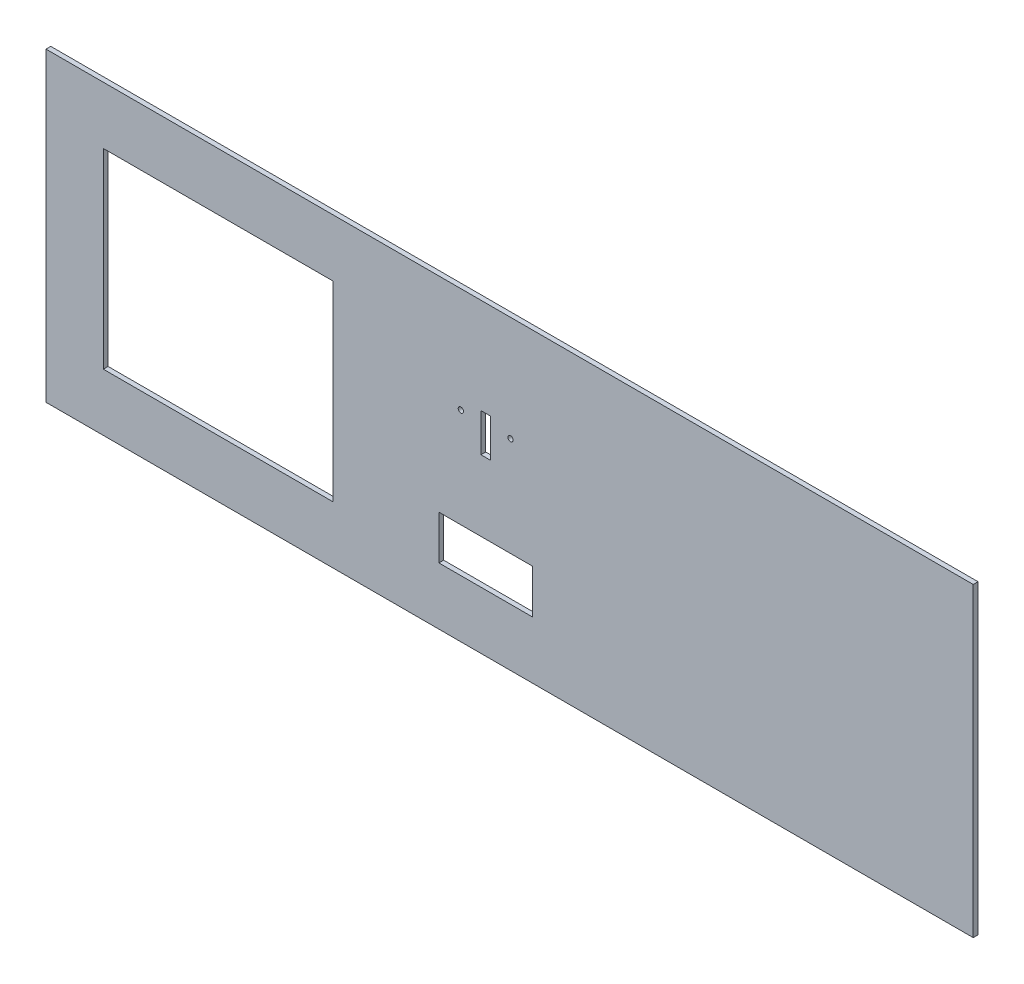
ISO-10303-21;
HEADER;
FILE_DESCRIPTION(('STEP AP214'),'2;1');
FILE_NAME('part.step','',(''),(''),'','','');
FILE_SCHEMA(('AUTOMOTIVE_DESIGN { 1 0 10303 214 1 1 1 1 }'));
ENDSEC;
DATA;
#1=APPLICATION_CONTEXT('core data for automotive mechanical design processes');
#2=APPLICATION_PROTOCOL_DEFINITION('international standard','automotive_design',2000,#1);
#3=PRODUCT_CONTEXT('',#1,'mechanical');
#4=PRODUCT('Part','Part','',(#3));
#5=PRODUCT_RELATED_PRODUCT_CATEGORY('part','',(#4));
#6=PRODUCT_DEFINITION_FORMATION('','',#4);
#7=PRODUCT_DEFINITION_CONTEXT('part definition',#1,'design');
#8=PRODUCT_DEFINITION('design','',#6,#7);
#9=PRODUCT_DEFINITION_SHAPE('','',#8);
#10=(LENGTH_UNIT() NAMED_UNIT(*) SI_UNIT(.MILLI.,.METRE.));
#11=(NAMED_UNIT(*) PLANE_ANGLE_UNIT() SI_UNIT($,.RADIAN.));
#12=(NAMED_UNIT(*) SI_UNIT($,.STERADIAN.) SOLID_ANGLE_UNIT());
#13=UNCERTAINTY_MEASURE_WITH_UNIT(LENGTH_MEASURE(1.E-05),#10,'distance_accuracy_value','');
#14=(GEOMETRIC_REPRESENTATION_CONTEXT(3) GLOBAL_UNCERTAINTY_ASSIGNED_CONTEXT((#13)) GLOBAL_UNIT_ASSIGNED_CONTEXT((#10,
#11,#12)) REPRESENTATION_CONTEXT('',''));
#15=CARTESIAN_POINT('',(0.,0.,0.));
#16=DIRECTION('',(0.,0.,1.));
#17=DIRECTION('',(1.,0.,0.));
#18=AXIS2_PLACEMENT_3D('',#15,#16,#17);
#19=CARTESIAN_POINT('',(307.975,-101.6,3.175));
#20=DIRECTION('',(-1.,0.,0.));
#21=DIRECTION('',(0.,0.,1.));
#22=AXIS2_PLACEMENT_3D('',#19,#20,#21);
#23=PLANE('',#22);
#24=DIRECTION('',(0.,1.,0.));
#25=VECTOR('',#24,1.);
#26=CARTESIAN_POINT('',(307.975,-101.6,0.));
#27=LINE('',#26,#25);
#28=CARTESIAN_POINT('',(307.975,-101.6,0.));
#29=VERTEX_POINT('',#28);
#30=CARTESIAN_POINT('',(307.975,101.6,0.));
#31=VERTEX_POINT('',#30);
#32=EDGE_CURVE('E285',#29,#31,#27,.T.);
#33=ORIENTED_EDGE('',*,*,#32,.T.);
#34=DIRECTION('',(0.,0.,-1.));
#35=VECTOR('',#34,1.);
#36=CARTESIAN_POINT('',(307.975,101.6,3.175));
#37=LINE('',#36,#35);
#38=CARTESIAN_POINT('',(307.975,101.6,3.175));
#39=VERTEX_POINT('',#38);
#40=EDGE_CURVE('E12',#39,#31,#37,.T.);
#41=ORIENTED_EDGE('',*,*,#40,.F.);
#42=DIRECTION('',(0.,1.,0.));
#43=VECTOR('',#42,1.);
#44=CARTESIAN_POINT('',(307.975,-101.6,3.175));
#45=LINE('',#44,#43);
#46=CARTESIAN_POINT('',(307.975,-101.6,3.175));
#47=VERTEX_POINT('',#46);
#48=EDGE_CURVE('E265',#47,#39,#45,.T.);
#49=ORIENTED_EDGE('',*,*,#48,.F.);
#50=DIRECTION('',(0.,0.,-1.));
#51=VECTOR('',#50,1.);
#52=CARTESIAN_POINT('',(307.975,-101.6,3.175));
#53=LINE('',#52,#51);
#54=EDGE_CURVE('E284',#47,#29,#53,.T.);
#55=ORIENTED_EDGE('',*,*,#54,.T.);
#56=EDGE_LOOP('',(#33,#41,#49,#55));
#57=FACE_BOUND('',#56,.T.);
#58=ADVANCED_FACE('F46',(#57),#23,.F.);
#59=CARTESIAN_POINT('',(-307.975,101.6,3.175));
#60=DIRECTION('',(0.,-1.,0.));
#61=DIRECTION('',(0.,0.,-1.));
#62=AXIS2_PLACEMENT_3D('',#59,#60,#61);
#63=PLANE('',#62);
#64=DIRECTION('',(-1.,0.,0.));
#65=VECTOR('',#64,1.);
#66=CARTESIAN_POINT('',(-307.975,101.6,0.));
#67=LINE('',#66,#65);
#68=CARTESIAN_POINT('',(-307.975,101.6,0.));
#69=VERTEX_POINT('',#68);
#70=EDGE_CURVE('E288',#31,#69,#67,.T.);
#71=ORIENTED_EDGE('',*,*,#70,.T.);
#72=DIRECTION('',(0.,0.,-1.));
#73=VECTOR('',#72,1.);
#74=CARTESIAN_POINT('',(-307.975,101.6,3.175));
#75=LINE('',#74,#73);
#76=CARTESIAN_POINT('',(-307.975,101.6,3.175));
#77=VERTEX_POINT('',#76);
#78=EDGE_CURVE('E53',#77,#69,#75,.T.);
#79=ORIENTED_EDGE('',*,*,#78,.F.);
#80=DIRECTION('',(-1.,0.,0.));
#81=VECTOR('',#80,1.);
#82=CARTESIAN_POINT('',(-307.975,101.6,3.175));
#83=LINE('',#82,#81);
#84=EDGE_CURVE('E270',#39,#77,#83,.T.);
#85=ORIENTED_EDGE('',*,*,#84,.F.);
#86=ORIENTED_EDGE('',*,*,#40,.T.);
#87=EDGE_LOOP('',(#71,#79,#85,#86));
#88=FACE_BOUND('',#87,.T.);
#89=ADVANCED_FACE('F318',(#88),#63,.F.);
#90=CARTESIAN_POINT('',(-307.975,-101.6,3.175));
#91=DIRECTION('',(1.,0.,0.));
#92=DIRECTION('',(0.,0.,-1.));
#93=AXIS2_PLACEMENT_3D('',#90,#91,#92);
#94=PLANE('',#93);
#95=DIRECTION('',(0.,-1.,0.));
#96=VECTOR('',#95,1.);
#97=CARTESIAN_POINT('',(-307.975,-101.6,0.));
#98=LINE('',#97,#96);
#99=CARTESIAN_POINT('',(-307.975,-101.6,0.));
#100=VERTEX_POINT('',#99);
#101=EDGE_CURVE('E291',#69,#100,#98,.T.);
#102=ORIENTED_EDGE('',*,*,#101,.T.);
#103=DIRECTION('',(0.,0.,-1.));
#104=VECTOR('',#103,1.);
#105=CARTESIAN_POINT('',(-307.975,-101.6,3.175));
#106=LINE('',#105,#104);
#107=CARTESIAN_POINT('',(-307.975,-101.6,3.175));
#108=VERTEX_POINT('',#107);
#109=EDGE_CURVE('E296',#108,#100,#106,.T.);
#110=ORIENTED_EDGE('',*,*,#109,.F.);
#111=DIRECTION('',(0.,-1.,0.));
#112=VECTOR('',#111,1.);
#113=CARTESIAN_POINT('',(-307.975,-101.6,3.175));
#114=LINE('',#113,#112);
#115=EDGE_CURVE('E277',#77,#108,#114,.T.);
#116=ORIENTED_EDGE('',*,*,#115,.F.);
#117=ORIENTED_EDGE('',*,*,#78,.T.);
#118=EDGE_LOOP('',(#102,#110,#116,#117));
#119=FACE_BOUND('',#118,.T.);
#120=ADVANCED_FACE('F303',(#119),#94,.F.);
#121=CARTESIAN_POINT('',(-307.975,-101.6,3.175));
#122=DIRECTION('',(0.,1.,0.));
#123=DIRECTION('',(0.,0.,1.));
#124=AXIS2_PLACEMENT_3D('',#121,#122,#123);
#125=PLANE('',#124);
#126=DIRECTION('',(1.,0.,0.));
#127=VECTOR('',#126,1.);
#128=CARTESIAN_POINT('',(-307.975,-101.6,0.));
#129=LINE('',#128,#127);
#130=EDGE_CURVE('E271',#100,#29,#129,.T.);
#131=ORIENTED_EDGE('',*,*,#130,.T.);
#132=ORIENTED_EDGE('',*,*,#54,.F.);
#133=DIRECTION('',(1.,0.,0.));
#134=VECTOR('',#133,1.);
#135=CARTESIAN_POINT('',(-307.975,-101.6,3.175));
#136=LINE('',#135,#134);
#137=EDGE_CURVE('E280',#108,#47,#136,.T.);
#138=ORIENTED_EDGE('',*,*,#137,.F.);
#139=ORIENTED_EDGE('',*,*,#109,.T.);
#140=EDGE_LOOP('',(#131,#132,#138,#139));
#141=FACE_BOUND('',#140,.T.);
#142=ADVANCED_FACE('F311',(#141),#125,.F.);
#143=CARTESIAN_POINT('',(0.,0.,3.175));
#144=DIRECTION('',(0.,0.,-1.));
#145=DIRECTION('',(-1.,0.,0.));
#146=AXIS2_PLACEMENT_3D('',#143,#144,#145);
#147=PLANE('',#146);
#148=DIRECTION('',(-1.,0.,0.));
#149=VECTOR('',#148,1.);
#150=CARTESIAN_POINT('',(-46.9899999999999,-34.29,3.175));
#151=LINE('',#150,#149);
#152=CARTESIAN_POINT('',(15.2400000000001,-34.29,3.175));
#153=VERTEX_POINT('',#152);
#154=CARTESIAN_POINT('',(-46.9899999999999,-34.29,3.175));
#155=VERTEX_POINT('',#154);
#156=EDGE_CURVE('E188',#153,#155,#151,.T.);
#157=ORIENTED_EDGE('',*,*,#156,.F.);
#158=DIRECTION('',(0.,1.,0.));
#159=VECTOR('',#158,1.);
#160=CARTESIAN_POINT('',(15.2400000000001,-63.5,3.175));
#161=LINE('',#160,#159);
#162=CARTESIAN_POINT('',(15.2400000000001,-63.5,3.175));
#163=VERTEX_POINT('',#162);
#164=EDGE_CURVE('E60',#163,#153,#161,.T.);
#165=ORIENTED_EDGE('',*,*,#164,.F.);
#166=DIRECTION('',(1.,0.,0.));
#167=VECTOR('',#166,1.);
#168=CARTESIAN_POINT('',(-46.9899999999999,-63.5,3.175));
#169=LINE('',#168,#167);
#170=CARTESIAN_POINT('',(-46.9899999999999,-63.5,3.175));
#171=VERTEX_POINT('',#170);
#172=EDGE_CURVE('E176',#171,#163,#169,.T.);
#173=ORIENTED_EDGE('',*,*,#172,.F.);
#174=DIRECTION('',(0.,-1.,0.));
#175=VECTOR('',#174,1.);
#176=CARTESIAN_POINT('',(-46.9899999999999,-63.5,3.175));
#177=LINE('',#176,#175);
#178=EDGE_CURVE('E180',#155,#171,#177,.T.);
#179=ORIENTED_EDGE('',*,*,#178,.F.);
#180=EDGE_LOOP('',(#157,#165,#173,#179));
#181=FACE_BOUND('',#180,.T.);
#182=CARTESIAN_POINT('',(0.635000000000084,31.75,3.175));
#183=DIRECTION('',(0.,0.,1.));
#184=DIRECTION('',(1.,0.,0.));
#185=AXIS2_PLACEMENT_3D('',#182,#183,#184);
#186=CIRCLE('',#185,1.75);
#187=CARTESIAN_POINT('',(2.38500000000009,31.75,3.175));
#188=VERTEX_POINT('',#187);
#189=EDGE_CURVE('E209',#188,#188,#186,.T.);
#190=ORIENTED_EDGE('',*,*,#189,.F.);
#191=EDGE_LOOP('',(#190));
#192=FACE_BOUND('',#191,.T.);
#193=CARTESIAN_POINT('',(-32.3849999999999,31.75,3.175));
#194=DIRECTION('',(0.,0.,1.));
#195=DIRECTION('',(-1.,0.,0.));
#196=AXIS2_PLACEMENT_3D('',#193,#194,#195);
#197=CIRCLE('',#196,1.75);
#198=CARTESIAN_POINT('',(-34.1349999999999,31.75,3.175));
#199=VERTEX_POINT('',#198);
#200=EDGE_CURVE('E214',#199,#199,#197,.T.);
#201=ORIENTED_EDGE('',*,*,#200,.F.);
#202=EDGE_LOOP('',(#201));
#203=FACE_BOUND('',#202,.T.);
#204=DIRECTION('',(-1.,0.,0.));
#205=VECTOR('',#204,1.);
#206=CARTESIAN_POINT('',(-19.0499999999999,38.1,3.175));
#207=LINE('',#206,#205);
#208=CARTESIAN_POINT('',(-12.6999999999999,38.1,3.175));
#209=VERTEX_POINT('',#208);
#210=CARTESIAN_POINT('',(-19.0499999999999,38.1,3.175));
#211=VERTEX_POINT('',#210);
#212=EDGE_CURVE('E223',#209,#211,#207,.T.);
#213=ORIENTED_EDGE('',*,*,#212,.F.);
#214=DIRECTION('',(0.,1.,0.));
#215=VECTOR('',#214,1.);
#216=CARTESIAN_POINT('',(-12.6999999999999,12.7,3.175));
#217=LINE('',#216,#215);
#218=CARTESIAN_POINT('',(-12.6999999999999,12.7,3.175));
#219=VERTEX_POINT('',#218);
#220=EDGE_CURVE('E208',#219,#209,#217,.T.);
#221=ORIENTED_EDGE('',*,*,#220,.F.);
#222=DIRECTION('',(1.,0.,0.));
#223=VECTOR('',#222,1.);
#224=CARTESIAN_POINT('',(-19.0499999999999,12.7,3.175));
#225=LINE('',#224,#223);
#226=CARTESIAN_POINT('',(-19.0499999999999,12.7,3.175));
#227=VERTEX_POINT('',#226);
#228=EDGE_CURVE('E235',#227,#219,#225,.T.);
#229=ORIENTED_EDGE('',*,*,#228,.F.);
#230=DIRECTION('',(0.,-1.,0.));
#231=VECTOR('',#230,1.);
#232=CARTESIAN_POINT('',(-19.0499999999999,12.7,3.175));
#233=LINE('',#232,#231);
#234=EDGE_CURVE('E228',#211,#227,#233,.T.);
#235=ORIENTED_EDGE('',*,*,#234,.F.);
#236=EDGE_LOOP('',(#213,#221,#229,#235));
#237=FACE_BOUND('',#236,.T.);
#238=DIRECTION('',(1.,0.,0.));
#239=VECTOR('',#238,1.);
#240=CARTESIAN_POINT('',(-269.875,-63.5,3.175));
#241=LINE('',#240,#239);
#242=CARTESIAN_POINT('',(-269.875,-63.5,3.175));
#243=VERTEX_POINT('',#242);
#244=CARTESIAN_POINT('',(-117.475,-63.5,3.175));
#245=VERTEX_POINT('',#244);
#246=EDGE_CURVE('E244',#243,#245,#241,.T.);
#247=ORIENTED_EDGE('',*,*,#246,.F.);
#248=DIRECTION('',(0.,-1.,0.));
#249=VECTOR('',#248,1.);
#250=CARTESIAN_POINT('',(-269.875,-63.5,3.175));
#251=LINE('',#250,#249);
#252=CARTESIAN_POINT('',(-269.875,63.5,3.175));
#253=VERTEX_POINT('',#252);
#254=EDGE_CURVE('E250',#253,#243,#251,.T.);
#255=ORIENTED_EDGE('',*,*,#254,.F.);
#256=DIRECTION('',(-1.,0.,0.));
#257=VECTOR('',#256,1.);
#258=CARTESIAN_POINT('',(-269.875,63.5,3.175));
#259=LINE('',#258,#257);
#260=CARTESIAN_POINT('',(-117.475,63.5,3.175));
#261=VERTEX_POINT('',#260);
#262=EDGE_CURVE('E257',#261,#253,#259,.T.);
#263=ORIENTED_EDGE('',*,*,#262,.F.);
#264=DIRECTION('',(0.,1.,0.));
#265=VECTOR('',#264,1.);
#266=CARTESIAN_POINT('',(-117.475,-63.5,3.175));
#267=LINE('',#266,#265);
#268=EDGE_CURVE('E249',#245,#261,#267,.T.);
#269=ORIENTED_EDGE('',*,*,#268,.F.);
#270=EDGE_LOOP('',(#247,#255,#263,#269));
#271=FACE_BOUND('',#270,.T.);
#272=ORIENTED_EDGE('',*,*,#48,.T.);
#273=ORIENTED_EDGE('',*,*,#84,.T.);
#274=ORIENTED_EDGE('',*,*,#115,.T.);
#275=ORIENTED_EDGE('',*,*,#137,.T.);
#276=EDGE_LOOP('',(#272,#273,#274,#275));
#277=FACE_BOUND('',#276,.T.);
#278=ADVANCED_FACE('F317',(#181,#192,#203,#237,#271,#277),#147,.F.);
#279=CARTESIAN_POINT('',(0.,0.,0.));
#280=DIRECTION('',(0.,0.,-1.));
#281=DIRECTION('',(-1.,0.,0.));
#282=AXIS2_PLACEMENT_3D('',#279,#280,#281);
#283=PLANE('',#282);
#284=DIRECTION('',(0.,1.,0.));
#285=VECTOR('',#284,1.);
#286=CARTESIAN_POINT('',(15.2400000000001,-63.5,0.));
#287=LINE('',#286,#285);
#288=CARTESIAN_POINT('',(15.2400000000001,-63.5,0.));
#289=VERTEX_POINT('',#288);
#290=CARTESIAN_POINT('',(15.2400000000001,-34.29,0.));
#291=VERTEX_POINT('',#290);
#292=EDGE_CURVE('E160',#289,#291,#287,.T.);
#293=ORIENTED_EDGE('',*,*,#292,.T.);
#294=DIRECTION('',(-1.,0.,0.));
#295=VECTOR('',#294,1.);
#296=CARTESIAN_POINT('',(-46.9899999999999,-34.29,0.));
#297=LINE('',#296,#295);
#298=CARTESIAN_POINT('',(-46.9899999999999,-34.29,0.));
#299=VERTEX_POINT('',#298);
#300=EDGE_CURVE('E169',#291,#299,#297,.T.);
#301=ORIENTED_EDGE('',*,*,#300,.T.);
#302=DIRECTION('',(0.,-1.,0.));
#303=VECTOR('',#302,1.);
#304=CARTESIAN_POINT('',(-46.9899999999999,-63.5,0.));
#305=LINE('',#304,#303);
#306=CARTESIAN_POINT('',(-46.9899999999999,-63.5,0.));
#307=VERTEX_POINT('',#306);
#308=EDGE_CURVE('E68',#299,#307,#305,.T.);
#309=ORIENTED_EDGE('',*,*,#308,.T.);
#310=DIRECTION('',(1.,0.,0.));
#311=VECTOR('',#310,1.);
#312=CARTESIAN_POINT('',(-46.9899999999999,-63.5,0.));
#313=LINE('',#312,#311);
#314=EDGE_CURVE('E166',#307,#289,#313,.T.);
#315=ORIENTED_EDGE('',*,*,#314,.T.);
#316=EDGE_LOOP('',(#293,#301,#309,#315));
#317=FACE_BOUND('',#316,.T.);
#318=CARTESIAN_POINT('',(0.635000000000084,31.75,0.));
#319=DIRECTION('',(0.,0.,1.));
#320=DIRECTION('',(1.,0.,0.));
#321=AXIS2_PLACEMENT_3D('',#318,#319,#320);
#322=CIRCLE('',#321,1.75);
#323=CARTESIAN_POINT('',(2.38500000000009,31.75,0.));
#324=VERTEX_POINT('',#323);
#325=EDGE_CURVE('E205',#324,#324,#322,.T.);
#326=ORIENTED_EDGE('',*,*,#325,.T.);
#327=EDGE_LOOP('',(#326));
#328=FACE_BOUND('',#327,.T.);
#329=CARTESIAN_POINT('',(-32.3849999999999,31.75,0.));
#330=DIRECTION('',(0.,0.,1.));
#331=DIRECTION('',(-1.,0.,0.));
#332=AXIS2_PLACEMENT_3D('',#329,#330,#331);
#333=CIRCLE('',#332,1.75);
#334=CARTESIAN_POINT('',(-34.1349999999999,31.75,0.));
#335=VERTEX_POINT('',#334);
#336=EDGE_CURVE('E201',#335,#335,#333,.T.);
#337=ORIENTED_EDGE('',*,*,#336,.T.);
#338=EDGE_LOOP('',(#337));
#339=FACE_BOUND('',#338,.T.);
#340=DIRECTION('',(0.,1.,0.));
#341=VECTOR('',#340,1.);
#342=CARTESIAN_POINT('',(-12.6999999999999,12.7,0.));
#343=LINE('',#342,#341);
#344=CARTESIAN_POINT('',(-12.6999999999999,12.7,0.));
#345=VERTEX_POINT('',#344);
#346=CARTESIAN_POINT('',(-12.6999999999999,38.1,0.));
#347=VERTEX_POINT('',#346);
#348=EDGE_CURVE('E396',#345,#347,#343,.T.);
#349=ORIENTED_EDGE('',*,*,#348,.T.);
#350=DIRECTION('',(-1.,0.,0.));
#351=VECTOR('',#350,1.);
#352=CARTESIAN_POINT('',(-19.0499999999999,38.1,0.));
#353=LINE('',#352,#351);
#354=CARTESIAN_POINT('',(-19.0499999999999,38.1,0.));
#355=VERTEX_POINT('',#354);
#356=EDGE_CURVE('E446',#347,#355,#353,.T.);
#357=ORIENTED_EDGE('',*,*,#356,.T.);
#358=DIRECTION('',(0.,-1.,0.));
#359=VECTOR('',#358,1.);
#360=CARTESIAN_POINT('',(-19.0499999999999,12.7,0.));
#361=LINE('',#360,#359);
#362=CARTESIAN_POINT('',(-19.0499999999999,12.7,0.));
#363=VERTEX_POINT('',#362);
#364=EDGE_CURVE('E449',#355,#363,#361,.T.);
#365=ORIENTED_EDGE('',*,*,#364,.T.);
#366=DIRECTION('',(1.,0.,0.));
#367=VECTOR('',#366,1.);
#368=CARTESIAN_POINT('',(-19.0499999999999,12.7,0.));
#369=LINE('',#368,#367);
#370=EDGE_CURVE('E431',#363,#345,#369,.T.);
#371=ORIENTED_EDGE('',*,*,#370,.T.);
#372=EDGE_LOOP('',(#349,#357,#365,#371));
#373=FACE_BOUND('',#372,.T.);
#374=DIRECTION('',(0.,-1.,0.));
#375=VECTOR('',#374,1.);
#376=CARTESIAN_POINT('',(-269.875,-63.5,0.));
#377=LINE('',#376,#375);
#378=CARTESIAN_POINT('',(-269.875,63.5,0.));
#379=VERTEX_POINT('',#378);
#380=CARTESIAN_POINT('',(-269.875,-63.5,0.));
#381=VERTEX_POINT('',#380);
#382=EDGE_CURVE('E401',#379,#381,#377,.T.);
#383=ORIENTED_EDGE('',*,*,#382,.T.);
#384=DIRECTION('',(1.,0.,0.));
#385=VECTOR('',#384,1.);
#386=CARTESIAN_POINT('',(-269.875,-63.5,0.));
#387=LINE('',#386,#385);
#388=CARTESIAN_POINT('',(-117.475,-63.5,0.));
#389=VERTEX_POINT('',#388);
#390=EDGE_CURVE('E405',#381,#389,#387,.T.);
#391=ORIENTED_EDGE('',*,*,#390,.T.);
#392=DIRECTION('',(0.,1.,0.));
#393=VECTOR('',#392,1.);
#394=CARTESIAN_POINT('',(-117.475,-63.5,0.));
#395=LINE('',#394,#393);
#396=CARTESIAN_POINT('',(-117.475,63.5,0.));
#397=VERTEX_POINT('',#396);
#398=EDGE_CURVE('E411',#389,#397,#395,.T.);
#399=ORIENTED_EDGE('',*,*,#398,.T.);
#400=DIRECTION('',(-1.,0.,0.));
#401=VECTOR('',#400,1.);
#402=CARTESIAN_POINT('',(-269.875,63.5,0.));
#403=LINE('',#402,#401);
#404=EDGE_CURVE('E418',#397,#379,#403,.T.);
#405=ORIENTED_EDGE('',*,*,#404,.T.);
#406=EDGE_LOOP('',(#383,#391,#399,#405));
#407=FACE_BOUND('',#406,.T.);
#408=ORIENTED_EDGE('',*,*,#32,.F.);
#409=ORIENTED_EDGE('',*,*,#130,.F.);
#410=ORIENTED_EDGE('',*,*,#101,.F.);
#411=ORIENTED_EDGE('',*,*,#70,.F.);
#412=EDGE_LOOP('',(#408,#409,#410,#411));
#413=FACE_BOUND('',#412,.T.);
#414=ADVANCED_FACE('F173',(#317,#328,#339,#373,#407,#413),#283,.T.);
#415=CARTESIAN_POINT('',(-269.875,-63.5,0.));
#416=DIRECTION('',(-1.,0.,0.));
#417=DIRECTION('',(0.,0.,1.));
#418=AXIS2_PLACEMENT_3D('',#415,#416,#417);
#419=PLANE('',#418);
#420=ORIENTED_EDGE('',*,*,#254,.T.);
#421=DIRECTION('',(0.,0.,1.));
#422=VECTOR('',#421,1.);
#423=CARTESIAN_POINT('',(-269.875,-63.5,0.));
#424=LINE('',#423,#422);
#425=EDGE_CURVE('E272',#381,#243,#424,.T.);
#426=ORIENTED_EDGE('',*,*,#425,.F.);
#427=ORIENTED_EDGE('',*,*,#382,.F.);
#428=DIRECTION('',(0.,0.,1.));
#429=VECTOR('',#428,1.);
#430=CARTESIAN_POINT('',(-269.875,63.5,0.));
#431=LINE('',#430,#429);
#432=EDGE_CURVE('E289',#379,#253,#431,.T.);
#433=ORIENTED_EDGE('',*,*,#432,.T.);
#434=EDGE_LOOP('',(#420,#426,#427,#433));
#435=FACE_BOUND('',#434,.T.);
#436=ADVANCED_FACE('F330',(#435),#419,.F.);
#437=CARTESIAN_POINT('',(-269.875,63.5,0.));
#438=DIRECTION('',(0.,1.,0.));
#439=DIRECTION('',(0.,0.,1.));
#440=AXIS2_PLACEMENT_3D('',#437,#438,#439);
#441=PLANE('',#440);
#442=ORIENTED_EDGE('',*,*,#262,.T.);
#443=ORIENTED_EDGE('',*,*,#432,.F.);
#444=ORIENTED_EDGE('',*,*,#404,.F.);
#445=DIRECTION('',(0.,0.,1.));
#446=VECTOR('',#445,1.);
#447=CARTESIAN_POINT('',(-117.475,63.5,0.));
#448=LINE('',#447,#446);
#449=EDGE_CURVE('E424',#397,#261,#448,.T.);
#450=ORIENTED_EDGE('',*,*,#449,.T.);
#451=EDGE_LOOP('',(#442,#443,#444,#450));
#452=FACE_BOUND('',#451,.T.);
#453=ADVANCED_FACE('F336',(#452),#441,.F.);
#454=CARTESIAN_POINT('',(-117.475,-63.5,0.));
#455=DIRECTION('',(1.,0.,0.));
#456=DIRECTION('',(0.,0.,-1.));
#457=AXIS2_PLACEMENT_3D('',#454,#455,#456);
#458=PLANE('',#457);
#459=ORIENTED_EDGE('',*,*,#268,.T.);
#460=ORIENTED_EDGE('',*,*,#449,.F.);
#461=ORIENTED_EDGE('',*,*,#398,.F.);
#462=DIRECTION('',(0.,0.,1.));
#463=VECTOR('',#462,1.);
#464=CARTESIAN_POINT('',(-117.475,-63.5,0.));
#465=LINE('',#464,#463);
#466=EDGE_CURVE('E421',#389,#245,#465,.T.);
#467=ORIENTED_EDGE('',*,*,#466,.T.);
#468=EDGE_LOOP('',(#459,#460,#461,#467));
#469=FACE_BOUND('',#468,.T.);
#470=ADVANCED_FACE('F342',(#469),#458,.F.);
#471=CARTESIAN_POINT('',(-269.875,-63.5,0.));
#472=DIRECTION('',(0.,-1.,0.));
#473=DIRECTION('',(0.,0.,-1.));
#474=AXIS2_PLACEMENT_3D('',#471,#472,#473);
#475=PLANE('',#474);
#476=ORIENTED_EDGE('',*,*,#246,.T.);
#477=ORIENTED_EDGE('',*,*,#466,.F.);
#478=ORIENTED_EDGE('',*,*,#390,.F.);
#479=ORIENTED_EDGE('',*,*,#425,.T.);
#480=EDGE_LOOP('',(#476,#477,#478,#479));
#481=FACE_BOUND('',#480,.T.);
#482=ADVANCED_FACE('F338',(#481),#475,.F.);
#483=CARTESIAN_POINT('',(-12.6999999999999,12.7,0.));
#484=DIRECTION('',(1.,0.,0.));
#485=DIRECTION('',(0.,0.,-1.));
#486=AXIS2_PLACEMENT_3D('',#483,#484,#485);
#487=PLANE('',#486);
#488=ORIENTED_EDGE('',*,*,#220,.T.);
#489=DIRECTION('',(0.,0.,1.));
#490=VECTOR('',#489,1.);
#491=CARTESIAN_POINT('',(-12.6999999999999,38.1,0.));
#492=LINE('',#491,#490);
#493=EDGE_CURVE('E414',#347,#209,#492,.T.);
#494=ORIENTED_EDGE('',*,*,#493,.F.);
#495=ORIENTED_EDGE('',*,*,#348,.F.);
#496=DIRECTION('',(0.,0.,1.));
#497=VECTOR('',#496,1.);
#498=CARTESIAN_POINT('',(-12.6999999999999,12.7,0.));
#499=LINE('',#498,#497);
#500=EDGE_CURVE('E399',#345,#219,#499,.T.);
#501=ORIENTED_EDGE('',*,*,#500,.T.);
#502=EDGE_LOOP('',(#488,#494,#495,#501));
#503=FACE_BOUND('',#502,.T.);
#504=ADVANCED_FACE('F341',(#503),#487,.F.);
#505=CARTESIAN_POINT('',(-19.0499999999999,12.7,0.));
#506=DIRECTION('',(0.,-1.,0.));
#507=DIRECTION('',(0.,0.,-1.));
#508=AXIS2_PLACEMENT_3D('',#505,#506,#507);
#509=PLANE('',#508);
#510=ORIENTED_EDGE('',*,*,#228,.T.);
#511=ORIENTED_EDGE('',*,*,#500,.F.);
#512=ORIENTED_EDGE('',*,*,#370,.F.);
#513=DIRECTION('',(0.,0.,1.));
#514=VECTOR('',#513,1.);
#515=CARTESIAN_POINT('',(-19.0499999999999,12.7,0.));
#516=LINE('',#515,#514);
#517=EDGE_CURVE('E433',#363,#227,#516,.T.);
#518=ORIENTED_EDGE('',*,*,#517,.T.);
#519=EDGE_LOOP('',(#510,#511,#512,#518));
#520=FACE_BOUND('',#519,.T.);
#521=ADVANCED_FACE('F352',(#520),#509,.F.);
#522=CARTESIAN_POINT('',(-19.0499999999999,12.7,0.));
#523=DIRECTION('',(-1.,0.,0.));
#524=DIRECTION('',(0.,0.,1.));
#525=AXIS2_PLACEMENT_3D('',#522,#523,#524);
#526=PLANE('',#525);
#527=ORIENTED_EDGE('',*,*,#234,.T.);
#528=ORIENTED_EDGE('',*,*,#517,.F.);
#529=ORIENTED_EDGE('',*,*,#364,.F.);
#530=DIRECTION('',(0.,0.,1.));
#531=VECTOR('',#530,1.);
#532=CARTESIAN_POINT('',(-19.0499999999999,38.1,0.));
#533=LINE('',#532,#531);
#534=EDGE_CURVE('E430',#355,#211,#533,.T.);
#535=ORIENTED_EDGE('',*,*,#534,.T.);
#536=EDGE_LOOP('',(#527,#528,#529,#535));
#537=FACE_BOUND('',#536,.T.);
#538=ADVANCED_FACE('F358',(#537),#526,.F.);
#539=CARTESIAN_POINT('',(-19.0499999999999,38.1,0.));
#540=DIRECTION('',(0.,1.,0.));
#541=DIRECTION('',(0.,0.,1.));
#542=AXIS2_PLACEMENT_3D('',#539,#540,#541);
#543=PLANE('',#542);
#544=ORIENTED_EDGE('',*,*,#212,.T.);
#545=ORIENTED_EDGE('',*,*,#534,.F.);
#546=ORIENTED_EDGE('',*,*,#356,.F.);
#547=ORIENTED_EDGE('',*,*,#493,.T.);
#548=EDGE_LOOP('',(#544,#545,#546,#547));
#549=FACE_BOUND('',#548,.T.);
#550=ADVANCED_FACE('F354',(#549),#543,.F.);
#551=CARTESIAN_POINT('',(-32.3849999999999,31.75,0.));
#552=DIRECTION('',(0.,0.,1.));
#553=DIRECTION('',(1.,0.,0.));
#554=AXIS2_PLACEMENT_3D('',#551,#552,#553);
#555=CYLINDRICAL_SURFACE('',#554,1.75);
#556=ORIENTED_EDGE('',*,*,#336,.F.);
#557=EDGE_LOOP('',(#556));
#558=FACE_BOUND('',#557,.T.);
#559=ORIENTED_EDGE('',*,*,#200,.T.);
#560=EDGE_LOOP('',(#559));
#561=FACE_BOUND('',#560,.T.);
#562=ADVANCED_FACE('F357',(#558,#561),#555,.F.);
#563=CARTESIAN_POINT('',(0.635000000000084,31.75,0.));
#564=DIRECTION('',(0.,0.,1.));
#565=DIRECTION('',(1.,0.,0.));
#566=AXIS2_PLACEMENT_3D('',#563,#564,#565);
#567=CYLINDRICAL_SURFACE('',#566,1.75);
#568=ORIENTED_EDGE('',*,*,#325,.F.);
#569=EDGE_LOOP('',(#568));
#570=FACE_BOUND('',#569,.T.);
#571=ORIENTED_EDGE('',*,*,#189,.T.);
#572=EDGE_LOOP('',(#571));
#573=FACE_BOUND('',#572,.T.);
#574=ADVANCED_FACE('F368',(#570,#573),#567,.F.);
#575=CARTESIAN_POINT('',(15.2400000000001,-63.5,0.));
#576=DIRECTION('',(1.,0.,0.));
#577=DIRECTION('',(0.,0.,-1.));
#578=AXIS2_PLACEMENT_3D('',#575,#576,#577);
#579=PLANE('',#578);
#580=ORIENTED_EDGE('',*,*,#164,.T.);
#581=DIRECTION('',(0.,0.,1.));
#582=VECTOR('',#581,1.);
#583=CARTESIAN_POINT('',(15.2400000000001,-34.29,0.));
#584=LINE('',#583,#582);
#585=EDGE_CURVE('E156',#291,#153,#584,.T.);
#586=ORIENTED_EDGE('',*,*,#585,.F.);
#587=ORIENTED_EDGE('',*,*,#292,.F.);
#588=DIRECTION('',(0.,0.,1.));
#589=VECTOR('',#588,1.);
#590=CARTESIAN_POINT('',(15.2400000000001,-63.5,0.));
#591=LINE('',#590,#589);
#592=EDGE_CURVE('E199',#289,#163,#591,.T.);
#593=ORIENTED_EDGE('',*,*,#592,.T.);
#594=EDGE_LOOP('',(#580,#586,#587,#593));
#595=FACE_BOUND('',#594,.T.);
#596=ADVANCED_FACE('F158',(#595),#579,.F.);
#597=CARTESIAN_POINT('',(-46.9899999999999,-63.5,0.));
#598=DIRECTION('',(0.,-1.,0.));
#599=DIRECTION('',(0.,0.,-1.));
#600=AXIS2_PLACEMENT_3D('',#597,#598,#599);
#601=PLANE('',#600);
#602=ORIENTED_EDGE('',*,*,#172,.T.);
#603=ORIENTED_EDGE('',*,*,#592,.F.);
#604=ORIENTED_EDGE('',*,*,#314,.F.);
#605=DIRECTION('',(0.,0.,1.));
#606=VECTOR('',#605,1.);
#607=CARTESIAN_POINT('',(-46.9899999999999,-63.5,0.));
#608=LINE('',#607,#606);
#609=EDGE_CURVE('E202',#307,#171,#608,.T.);
#610=ORIENTED_EDGE('',*,*,#609,.T.);
#611=EDGE_LOOP('',(#602,#603,#604,#610));
#612=FACE_BOUND('',#611,.T.);
#613=ADVANCED_FACE('F375',(#612),#601,.F.);
#614=CARTESIAN_POINT('',(-46.9899999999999,-63.5,0.));
#615=DIRECTION('',(-1.,0.,0.));
#616=DIRECTION('',(0.,0.,1.));
#617=AXIS2_PLACEMENT_3D('',#614,#615,#616);
#618=PLANE('',#617);
#619=ORIENTED_EDGE('',*,*,#178,.T.);
#620=ORIENTED_EDGE('',*,*,#609,.F.);
#621=ORIENTED_EDGE('',*,*,#308,.F.);
#622=DIRECTION('',(0.,0.,1.));
#623=VECTOR('',#622,1.);
#624=CARTESIAN_POINT('',(-46.9899999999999,-34.29,0.));
#625=LINE('',#624,#623);
#626=EDGE_CURVE('E165',#299,#155,#625,.T.);
#627=ORIENTED_EDGE('',*,*,#626,.T.);
#628=EDGE_LOOP('',(#619,#620,#621,#627));
#629=FACE_BOUND('',#628,.T.);
#630=ADVANCED_FACE('F378',(#629),#618,.F.);
#631=CARTESIAN_POINT('',(-46.9899999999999,-34.29,0.));
#632=DIRECTION('',(0.,1.,0.));
#633=DIRECTION('',(0.,0.,1.));
#634=AXIS2_PLACEMENT_3D('',#631,#632,#633);
#635=PLANE('',#634);
#636=ORIENTED_EDGE('',*,*,#156,.T.);
#637=ORIENTED_EDGE('',*,*,#626,.F.);
#638=ORIENTED_EDGE('',*,*,#300,.F.);
#639=ORIENTED_EDGE('',*,*,#585,.T.);
#640=EDGE_LOOP('',(#636,#637,#638,#639));
#641=FACE_BOUND('',#640,.T.);
#642=ADVANCED_FACE('F170',(#641),#635,.F.);
#643=CLOSED_SHELL('',(#58,#89,#120,#142,#278,#414,#436,#453,#470,#482,#504,#521,#538,#550,#562,
#574,#596,#613,#630,#642));
#644=MANIFOLD_SOLID_BREP('B2',#643);
#645=ADVANCED_BREP_SHAPE_REPRESENTATION('',(#18,#644),#14);
#646=SHAPE_DEFINITION_REPRESENTATION(#9,#645);
ENDSEC;
END-ISO-10303-21;
